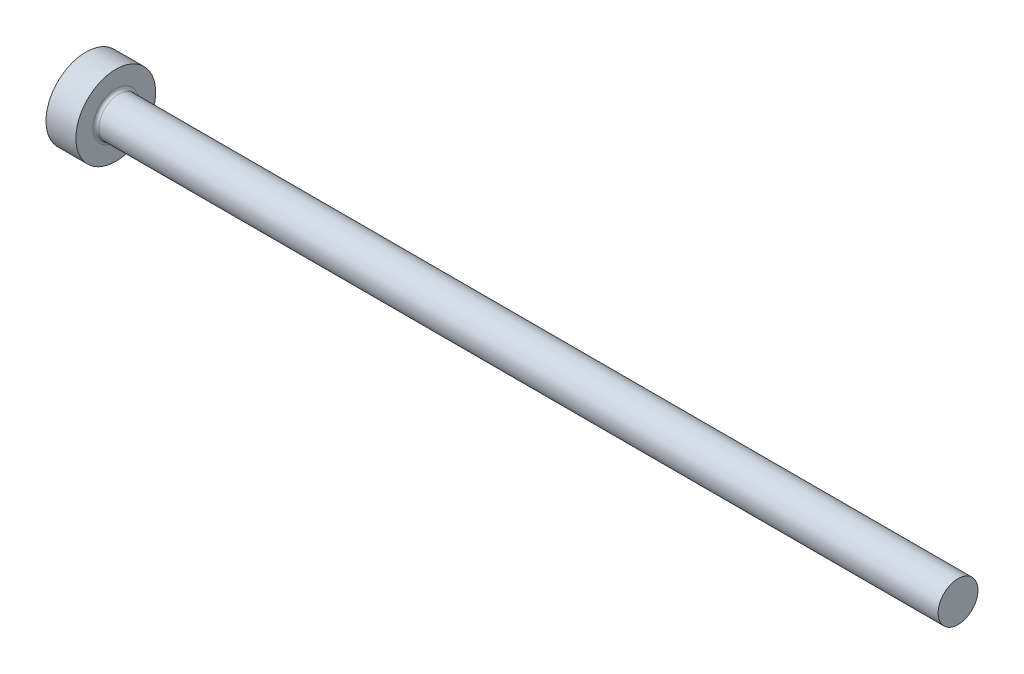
ISO-10303-21;
HEADER;
FILE_DESCRIPTION(('STEP AP214'),'2;1');
FILE_NAME('part.step','',(''),(''),'','','');
FILE_SCHEMA(('AUTOMOTIVE_DESIGN { 1 0 10303 214 1 1 1 1 }'));
ENDSEC;
DATA;
#1=APPLICATION_CONTEXT('core data for automotive mechanical design processes');
#2=APPLICATION_PROTOCOL_DEFINITION('international standard','automotive_design',2000,#1);
#3=PRODUCT_CONTEXT('',#1,'mechanical');
#4=PRODUCT('Part','Part','',(#3));
#5=PRODUCT_RELATED_PRODUCT_CATEGORY('part','',(#4));
#6=PRODUCT_DEFINITION_FORMATION('','',#4);
#7=PRODUCT_DEFINITION_CONTEXT('part definition',#1,'design');
#8=PRODUCT_DEFINITION('design','',#6,#7);
#9=PRODUCT_DEFINITION_SHAPE('','',#8);
#10=(LENGTH_UNIT() NAMED_UNIT(*) SI_UNIT(.MILLI.,.METRE.));
#11=(NAMED_UNIT(*) PLANE_ANGLE_UNIT() SI_UNIT($,.RADIAN.));
#12=(NAMED_UNIT(*) SI_UNIT($,.STERADIAN.) SOLID_ANGLE_UNIT());
#13=UNCERTAINTY_MEASURE_WITH_UNIT(LENGTH_MEASURE(1.E-05),#10,'distance_accuracy_value','');
#14=(GEOMETRIC_REPRESENTATION_CONTEXT(3) GLOBAL_UNCERTAINTY_ASSIGNED_CONTEXT((#13)) GLOBAL_UNIT_ASSIGNED_CONTEXT((#10,
#11,#12)) REPRESENTATION_CONTEXT('',''));
#15=CARTESIAN_POINT('',(0.,0.,0.));
#16=DIRECTION('',(0.,0.,1.));
#17=DIRECTION('',(1.,0.,0.));
#18=AXIS2_PLACEMENT_3D('',#15,#16,#17);
#19=CARTESIAN_POINT('',(0.,0.,0.));
#20=DIRECTION('',(-1.,0.,0.));
#21=DIRECTION('',(0.,0.,1.00000000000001));
#22=AXIS2_PLACEMENT_3D('',#19,#20,#21);
#23=CYLINDRICAL_SURFACE('',#22,2.);
#24=CARTESIAN_POINT('',(3.29999999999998,0.,0.));
#25=DIRECTION('',(-1.,0.,0.));
#26=DIRECTION('',(0.,0.,1.00000000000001));
#27=AXIS2_PLACEMENT_3D('',#24,#25,#26);
#28=CIRCLE('',#27,2.);
#29=CARTESIAN_POINT('',(3.29999999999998,0.,1.99999999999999));
#30=VERTEX_POINT('',#29);
#31=EDGE_CURVE('E41',#30,#30,#28,.T.);
#32=ORIENTED_EDGE('',*,*,#31,.F.);
#33=EDGE_LOOP('',(#32));
#34=FACE_BOUND('',#33,.T.);
#35=CARTESIAN_POINT('',(87.47,0.,0.));
#36=DIRECTION('',(1.,0.,0.));
#37=DIRECTION('',(0.,0.,-1.00000000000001));
#38=AXIS2_PLACEMENT_3D('',#35,#36,#37);
#39=CIRCLE('',#38,2.);
#40=CARTESIAN_POINT('',(87.47,0.,-2.00000000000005));
#41=VERTEX_POINT('',#40);
#42=EDGE_CURVE('E46',#41,#41,#39,.T.);
#43=ORIENTED_EDGE('',*,*,#42,.F.);
#44=EDGE_LOOP('',(#43));
#45=FACE_BOUND('',#44,.T.);
#46=ADVANCED_FACE('F26',(#34,#45),#23,.T.);
#47=CARTESIAN_POINT('',(0.,0.,0.));
#48=DIRECTION('',(-1.,0.,0.));
#49=DIRECTION('',(0.,0.,1.00000000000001));
#50=AXIS2_PLACEMENT_3D('',#47,#48,#49);
#51=PLANE('',#50);
#52=CARTESIAN_POINT('',(0.,0.,0.));
#53=DIRECTION('',(-1.,0.,0.));
#54=DIRECTION('',(0.,0.,1.00000000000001));
#55=AXIS2_PLACEMENT_3D('',#52,#53,#54);
#56=CIRCLE('',#55,4.);
#57=CARTESIAN_POINT('',(0.,0.,4.00000000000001));
#58=VERTEX_POINT('',#57);
#59=EDGE_CURVE('E10',#58,#58,#56,.T.);
#60=ORIENTED_EDGE('',*,*,#59,.T.);
#61=EDGE_LOOP('',(#60));
#62=FACE_BOUND('',#61,.T.);
#63=ADVANCED_FACE('F28',(#62),#51,.T.);
#64=CARTESIAN_POINT('',(0.,0.,0.));
#65=DIRECTION('',(-1.,0.,0.));
#66=DIRECTION('',(0.,0.,1.00000000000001));
#67=AXIS2_PLACEMENT_3D('',#64,#65,#66);
#68=CYLINDRICAL_SURFACE('',#67,4.);
#69=CARTESIAN_POINT('',(2.99999999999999,0.,0.));
#70=DIRECTION('',(-1.,0.,0.));
#71=DIRECTION('',(0.,0.,1.00000000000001));
#72=AXIS2_PLACEMENT_3D('',#69,#70,#71);
#73=CIRCLE('',#72,4.);
#74=CARTESIAN_POINT('',(2.99999999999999,0.,4.00000000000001));
#75=VERTEX_POINT('',#74);
#76=EDGE_CURVE('E33',#75,#75,#73,.T.);
#77=ORIENTED_EDGE('',*,*,#76,.T.);
#78=EDGE_LOOP('',(#77));
#79=FACE_BOUND('',#78,.T.);
#80=ORIENTED_EDGE('',*,*,#59,.F.);
#81=EDGE_LOOP('',(#80));
#82=FACE_BOUND('',#81,.T.);
#83=ADVANCED_FACE('F58',(#79,#82),#68,.T.);
#84=CARTESIAN_POINT('',(2.99999999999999,4.,0.));
#85=DIRECTION('',(1.,0.,0.));
#86=DIRECTION('',(0.,0.,-1.00000000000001));
#87=AXIS2_PLACEMENT_3D('',#84,#85,#86);
#88=PLANE('',#87);
#89=CARTESIAN_POINT('',(2.99999999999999,0.,0.));
#90=DIRECTION('',(-1.,0.,0.));
#91=DIRECTION('',(0.,0.,1.00000000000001));
#92=AXIS2_PLACEMENT_3D('',#89,#90,#91);
#93=CIRCLE('',#92,2.3);
#94=CARTESIAN_POINT('',(2.99999999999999,0.,2.3));
#95=VERTEX_POINT('',#94);
#96=EDGE_CURVE('E37',#95,#95,#93,.T.);
#97=ORIENTED_EDGE('',*,*,#96,.T.);
#98=EDGE_LOOP('',(#97));
#99=FACE_BOUND('',#98,.T.);
#100=ORIENTED_EDGE('',*,*,#76,.F.);
#101=EDGE_LOOP('',(#100));
#102=FACE_BOUND('',#101,.T.);
#103=ADVANCED_FACE('F65',(#99,#102),#88,.T.);
#104=CARTESIAN_POINT('',(3.29999999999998,0.,0.));
#105=DIRECTION('',(-1.,0.,0.));
#106=DIRECTION('',(0.,0.,1.00000000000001));
#107=AXIS2_PLACEMENT_3D('',#104,#105,#106);
#108=TOROIDAL_SURFACE('',#107,2.3,0.3);
#109=ORIENTED_EDGE('',*,*,#31,.T.);
#110=EDGE_LOOP('',(#109));
#111=FACE_BOUND('',#110,.T.);
#112=ORIENTED_EDGE('',*,*,#96,.F.);
#113=EDGE_LOOP('',(#112));
#114=FACE_BOUND('',#113,.T.);
#115=ADVANCED_FACE('F62',(#111,#114),#108,.F.);
#116=CARTESIAN_POINT('',(87.47,0.,0.));
#117=DIRECTION('',(1.,0.,0.));
#118=DIRECTION('',(0.,0.,-1.00000000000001));
#119=AXIS2_PLACEMENT_3D('',#116,#117,#118);
#120=PLANE('',#119);
#121=ORIENTED_EDGE('',*,*,#42,.T.);
#122=EDGE_LOOP('',(#121));
#123=FACE_BOUND('',#122,.T.);
#124=ADVANCED_FACE('F50',(#123),#120,.T.);
#125=CLOSED_SHELL('',(#46,#63,#83,#103,#115,#124));
#126=MANIFOLD_SOLID_BREP('B2',#125);
#127=ADVANCED_BREP_SHAPE_REPRESENTATION('',(#18,#126),#14);
#128=SHAPE_DEFINITION_REPRESENTATION(#9,#127);
ENDSEC;
END-ISO-10303-21;
